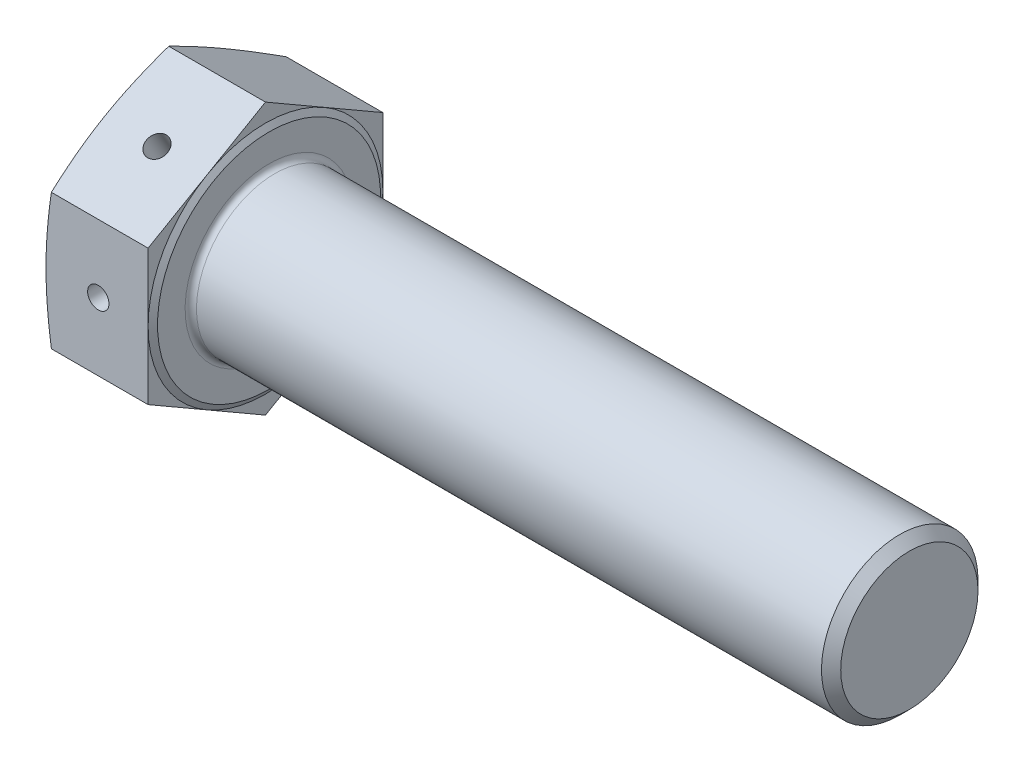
ISO-10303-21;
HEADER;
FILE_DESCRIPTION(('STEP AP214'),'2;1');
FILE_NAME('part.step','',(''),(''),'','','');
FILE_SCHEMA(('AUTOMOTIVE_DESIGN { 1 0 10303 214 1 1 1 1 }'));
ENDSEC;
DATA;
#1=APPLICATION_CONTEXT('core data for automotive mechanical design processes');
#2=APPLICATION_PROTOCOL_DEFINITION('international standard','automotive_design',2000,#1);
#3=PRODUCT_CONTEXT('',#1,'mechanical');
#4=PRODUCT('Part','Part','',(#3));
#5=PRODUCT_RELATED_PRODUCT_CATEGORY('part','',(#4));
#6=PRODUCT_DEFINITION_FORMATION('','',#4);
#7=PRODUCT_DEFINITION_CONTEXT('part definition',#1,'design');
#8=PRODUCT_DEFINITION('design','',#6,#7);
#9=PRODUCT_DEFINITION_SHAPE('','',#8);
#10=(LENGTH_UNIT() NAMED_UNIT(*) SI_UNIT(.MILLI.,.METRE.));
#11=(NAMED_UNIT(*) PLANE_ANGLE_UNIT() SI_UNIT($,.RADIAN.));
#12=(NAMED_UNIT(*) SI_UNIT($,.STERADIAN.) SOLID_ANGLE_UNIT());
#13=UNCERTAINTY_MEASURE_WITH_UNIT(LENGTH_MEASURE(1.E-05),#10,'distance_accuracy_value','');
#14=(GEOMETRIC_REPRESENTATION_CONTEXT(3) GLOBAL_UNCERTAINTY_ASSIGNED_CONTEXT((#13)) GLOBAL_UNIT_ASSIGNED_CONTEXT((#10,
#11,#12)) REPRESENTATION_CONTEXT('',''));
#15=CARTESIAN_POINT('',(0.,0.,0.));
#16=DIRECTION('',(0.,0.,1.));
#17=DIRECTION('',(1.,0.,0.));
#18=AXIS2_PLACEMENT_3D('',#15,#16,#17);
#19=CARTESIAN_POINT('',(7.35,0.,-16.5));
#20=DIRECTION('',(0.,0.,1.));
#21=DIRECTION('',(1.,0.,0.));
#22=AXIS2_PLACEMENT_3D('',#19,#20,#21);
#23=CYLINDRICAL_SURFACE('',#22,1.5);
#24=CARTESIAN_POINT('',(7.35,0.,16.5));
#25=DIRECTION('',(0.,0.,1.));
#26=DIRECTION('',(1.,0.,0.));
#27=AXIS2_PLACEMENT_3D('',#24,#25,#26);
#28=CIRCLE('',#27,1.5);
#29=CARTESIAN_POINT('',(8.85,0.,16.5));
#30=VERTEX_POINT('',#29);
#31=EDGE_CURVE('E584',#30,#30,#28,.T.);
#32=ORIENTED_EDGE('',*,*,#31,.T.);
#33=EDGE_LOOP('',(#32));
#34=FACE_BOUND('',#33,.T.);
#35=CARTESIAN_POINT('',(7.35,0.,0.));
#36=DIRECTION('',(0.,-0.866025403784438,0.500000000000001));
#37=DIRECTION('',(0.,0.500000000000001,0.866025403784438));
#38=AXIS2_PLACEMENT_3D('',#35,#36,#37);
#39=ELLIPSE('',#38,2.99999999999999,1.5);
#40=CARTESIAN_POINT('',(5.85,0.,0.));
#41=VERTEX_POINT('',#40);
#42=CARTESIAN_POINT('',(8.85,0.,0.));
#43=VERTEX_POINT('',#42);
#44=EDGE_CURVE('E46',#41,#43,#39,.F.);
#45=ORIENTED_EDGE('',*,*,#44,.T.);
#46=CARTESIAN_POINT('',(7.35,0.,0.));
#47=DIRECTION('',(0.,0.500000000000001,0.866025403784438));
#48=DIRECTION('',(0.,-0.866025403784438,0.500000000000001));
#49=AXIS2_PLACEMENT_3D('',#46,#47,#48);
#50=ELLIPSE('',#49,1.73205080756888,1.5);
#51=EDGE_CURVE('E11',#43,#41,#50,.F.);
#52=ORIENTED_EDGE('',*,*,#51,.T.);
#53=EDGE_LOOP('',(#45,#52));
#54=FACE_BOUND('',#53,.T.);
#55=ADVANCED_FACE('F32',(#34,#54),#23,.F.);
#56=CARTESIAN_POINT('',(14.85,0.,0.));
#57=DIRECTION('',(-1.,0.,0.));
#58=DIRECTION('',(0.,-1.,0.));
#59=AXIS2_PLACEMENT_3D('',#56,#57,#58);
#60=PLANE('',#59);
#61=CARTESIAN_POINT('',(14.85,0.,0.));
#62=DIRECTION('',(-1.,0.,0.));
#63=DIRECTION('',(0.,-1.,0.));
#64=AXIS2_PLACEMENT_3D('',#61,#62,#63);
#65=CIRCLE('',#64,11.8);
#66=CARTESIAN_POINT('',(14.85,-11.8,0.));
#67=VERTEX_POINT('',#66);
#68=EDGE_CURVE('E137',#67,#67,#65,.T.);
#69=ORIENTED_EDGE('',*,*,#68,.T.);
#70=EDGE_LOOP('',(#69));
#71=FACE_BOUND('',#70,.T.);
#72=CARTESIAN_POINT('',(14.85,0.,0.));
#73=DIRECTION('',(-1.,0.,0.));
#74=DIRECTION('',(0.,-1.,0.));
#75=AXIS2_PLACEMENT_3D('',#72,#73,#74);
#76=CIRCLE('',#75,15.675);
#77=CARTESIAN_POINT('',(14.85,-15.675,0.));
#78=VERTEX_POINT('',#77);
#79=EDGE_CURVE('E284',#78,#78,#76,.T.);
#80=ORIENTED_EDGE('',*,*,#79,.F.);
#81=EDGE_LOOP('',(#80));
#82=FACE_BOUND('',#81,.T.);
#83=ADVANCED_FACE('F239',(#71,#82),#60,.F.);
#84=CARTESIAN_POINT('',(14.35,-19.0525588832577,0.));
#85=DIRECTION('',(1.,0.,0.));
#86=DIRECTION('',(0.,0.,-1.));
#87=AXIS2_PLACEMENT_3D('',#84,#85,#86);
#88=PLANE('',#87);
#89=DIRECTION('',(0.,-0.5,-0.866025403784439));
#90=VECTOR('',#89,1.);
#91=CARTESIAN_POINT('',(14.35,-9.52627944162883,16.5));
#92=LINE('',#91,#90);
#93=CARTESIAN_POINT('',(14.35,-9.52627944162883,16.5));
#94=VERTEX_POINT('',#93);
#95=CARTESIAN_POINT('',(14.35,-14.2894191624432,8.25000000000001));
#96=VERTEX_POINT('',#95);
#97=EDGE_CURVE('E197',#94,#96,#92,.T.);
#98=ORIENTED_EDGE('',*,*,#97,.T.);
#99=CARTESIAN_POINT('',(14.35,0.,0.));
#100=DIRECTION('',(-1.,0.,0.));
#101=DIRECTION('',(0.,-1.,0.));
#102=AXIS2_PLACEMENT_3D('',#99,#100,#101);
#103=CIRCLE('',#102,16.5);
#104=CARTESIAN_POINT('',(14.35,0.,16.5));
#105=VERTEX_POINT('',#104);
#106=EDGE_CURVE('E54',#96,#105,#103,.T.);
#107=ORIENTED_EDGE('',*,*,#106,.T.);
#108=DIRECTION('',(0.,-1.,0.));
#109=VECTOR('',#108,1.);
#110=CARTESIAN_POINT('',(14.35,9.52627944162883,16.5));
#111=LINE('',#110,#109);
#112=EDGE_CURVE('E180',#105,#94,#111,.T.);
#113=ORIENTED_EDGE('',*,*,#112,.T.);
#114=EDGE_LOOP('',(#98,#107,#113));
#115=FACE_BOUND('',#114,.T.);
#116=ADVANCED_FACE('F245',(#115),#88,.T.);
#117=CARTESIAN_POINT('',(14.35,9.52627944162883,16.5));
#118=VERTEX_POINT('',#117);
#119=EDGE_CURVE('E177',#118,#105,#111,.T.);
#120=ORIENTED_EDGE('',*,*,#119,.T.);
#121=CARTESIAN_POINT('',(14.35,14.2894191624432,8.25));
#122=VERTEX_POINT('',#121);
#123=EDGE_CURVE('E153',#105,#122,#103,.T.);
#124=ORIENTED_EDGE('',*,*,#123,.T.);
#125=DIRECTION('',(0.,-0.5,0.866025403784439));
#126=VECTOR('',#125,1.);
#127=CARTESIAN_POINT('',(14.35,19.0525588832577,0.));
#128=LINE('',#127,#126);
#129=EDGE_CURVE('E184',#122,#118,#128,.T.);
#130=ORIENTED_EDGE('',*,*,#129,.T.);
#131=EDGE_LOOP('',(#120,#124,#130));
#132=FACE_BOUND('',#131,.T.);
#133=ADVANCED_FACE('F341',(#132),#88,.T.);
#134=CARTESIAN_POINT('',(14.35,19.0525588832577,0.));
#135=VERTEX_POINT('',#134);
#136=EDGE_CURVE('E181',#135,#122,#128,.T.);
#137=ORIENTED_EDGE('',*,*,#136,.T.);
#138=CARTESIAN_POINT('',(14.35,14.2894191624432,-8.25));
#139=VERTEX_POINT('',#138);
#140=EDGE_CURVE('E346',#122,#139,#103,.T.);
#141=ORIENTED_EDGE('',*,*,#140,.T.);
#142=DIRECTION('',(0.,0.5,0.866025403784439));
#143=VECTOR('',#142,1.);
#144=CARTESIAN_POINT('',(14.35,9.52627944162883,-16.5));
#145=LINE('',#144,#143);
#146=EDGE_CURVE('E188',#139,#135,#145,.T.);
#147=ORIENTED_EDGE('',*,*,#146,.T.);
#148=EDGE_LOOP('',(#137,#141,#147));
#149=FACE_BOUND('',#148,.T.);
#150=ADVANCED_FACE('F345',(#149),#88,.T.);
#151=CARTESIAN_POINT('',(14.35,9.52627944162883,-16.5));
#152=VERTEX_POINT('',#151);
#153=EDGE_CURVE('E185',#152,#139,#145,.T.);
#154=ORIENTED_EDGE('',*,*,#153,.T.);
#155=CARTESIAN_POINT('',(14.35,0.,-16.5));
#156=VERTEX_POINT('',#155);
#157=EDGE_CURVE('E405',#139,#156,#103,.T.);
#158=ORIENTED_EDGE('',*,*,#157,.T.);
#159=DIRECTION('',(0.,1.,0.));
#160=VECTOR('',#159,1.);
#161=CARTESIAN_POINT('',(14.35,-9.52627944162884,-16.5));
#162=LINE('',#161,#160);
#163=EDGE_CURVE('E192',#156,#152,#162,.T.);
#164=ORIENTED_EDGE('',*,*,#163,.T.);
#165=EDGE_LOOP('',(#154,#158,#164));
#166=FACE_BOUND('',#165,.T.);
#167=ADVANCED_FACE('F398',(#166),#88,.T.);
#168=CARTESIAN_POINT('',(14.35,-9.52627944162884,-16.5));
#169=VERTEX_POINT('',#168);
#170=EDGE_CURVE('E189',#169,#156,#162,.T.);
#171=ORIENTED_EDGE('',*,*,#170,.T.);
#172=CARTESIAN_POINT('',(14.35,-14.2894191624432,-8.25));
#173=VERTEX_POINT('',#172);
#174=EDGE_CURVE('E403',#156,#173,#103,.T.);
#175=ORIENTED_EDGE('',*,*,#174,.T.);
#176=DIRECTION('',(0.,0.5,-0.866025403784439));
#177=VECTOR('',#176,1.);
#178=CARTESIAN_POINT('',(14.35,-19.0525588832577,0.));
#179=LINE('',#178,#177);
#180=EDGE_CURVE('E196',#173,#169,#179,.T.);
#181=ORIENTED_EDGE('',*,*,#180,.T.);
#182=EDGE_LOOP('',(#171,#175,#181));
#183=FACE_BOUND('',#182,.T.);
#184=ADVANCED_FACE('F393',(#183),#88,.T.);
#185=CARTESIAN_POINT('',(14.35,-19.0525588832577,0.));
#186=VERTEX_POINT('',#185);
#187=EDGE_CURVE('E193',#186,#173,#179,.T.);
#188=ORIENTED_EDGE('',*,*,#187,.T.);
#189=EDGE_CURVE('E292',#173,#96,#103,.T.);
#190=ORIENTED_EDGE('',*,*,#189,.T.);
#191=EDGE_CURVE('E200',#96,#186,#92,.T.);
#192=ORIENTED_EDGE('',*,*,#191,.T.);
#193=EDGE_LOOP('',(#188,#190,#192));
#194=FACE_BOUND('',#193,.T.);
#195=ADVANCED_FACE('F234',(#194),#88,.T.);
#196=CARTESIAN_POINT('',(14.35,-9.52627944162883,16.5));
#197=DIRECTION('',(0.,0.866025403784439,-0.5));
#198=DIRECTION('',(0.,0.5,0.866025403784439));
#199=AXIS2_PLACEMENT_3D('',#196,#197,#198);
#200=PLANE('',#199);
#201=CARTESIAN_POINT('',(0.756136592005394,-19.0526743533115,-0.000200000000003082));
#202=CARTESIAN_POINT('',(0.697583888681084,-18.8549969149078,0.342187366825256));
#203=CARTESIAN_POINT('',(0.641700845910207,-18.6571223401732,0.684916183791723));
#204=CARTESIAN_POINT('',(0.535835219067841,-18.2609673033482,1.37107683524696));
#205=CARTESIAN_POINT('',(0.485852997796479,-18.0626868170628,1.71450871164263));
#206=CARTESIAN_POINT('',(0.345568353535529,-17.4670798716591,2.74613020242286));
#207=CARTESIAN_POINT('',(0.264980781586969,-17.0691629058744,3.43534260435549));
#208=CARTESIAN_POINT('',(0.134453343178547,-16.2745788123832,4.81160262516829));
#209=CARTESIAN_POINT('',(0.0843237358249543,-15.877919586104,5.49863655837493));
#210=CARTESIAN_POINT('',(0.0171010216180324,-15.0839798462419,6.87378052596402));
#211=CARTESIAN_POINT('',(0.,-14.6866995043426,7.56189026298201));
#212=CARTESIAN_POINT('',(0.,-13.8921388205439,8.93810973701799));
#213=CARTESIAN_POINT('',(0.0171010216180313,-13.4948584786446,9.62621947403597));
#214=CARTESIAN_POINT('',(0.0843237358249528,-12.7009187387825,11.0013634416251));
#215=CARTESIAN_POINT('',(0.134453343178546,-12.3042595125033,11.6883973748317));
#216=CARTESIAN_POINT('',(0.264980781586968,-11.5096754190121,13.0646573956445));
#217=CARTESIAN_POINT('',(0.345568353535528,-11.1117584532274,13.7538697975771));
#218=CARTESIAN_POINT('',(0.485852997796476,-10.5161515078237,14.7854912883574));
#219=CARTESIAN_POINT('',(0.535835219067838,-10.3178710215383,15.128923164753));
#220=CARTESIAN_POINT('',(0.641700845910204,-9.92171598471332,15.8150838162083));
#221=CARTESIAN_POINT('',(0.697583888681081,-9.72384140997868,16.1578126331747));
#222=CARTESIAN_POINT('',(0.756136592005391,-9.52616397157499,16.5002));
#223=B_SPLINE_CURVE_WITH_KNOTS('',3,(#201,#202,#203,#204,#205,#206,#207,#208,#209,#210,#211,
#212,#213,#214,#215,#216,#217,#218,#219,#220,#221,#222),.UNSPECIFIED.,.F.,.F.,(4,2,2,2,2,2,2,2,
2,2,4),(0.,1.19898576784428,2.39804521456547,4.79722541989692,7.18130221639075,9.5648076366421,
11.9483130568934,14.3323898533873,16.7315700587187,17.9306295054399,19.1296152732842),.UNSPECIFIED.);
#224=CARTESIAN_POINT('',(0.75610238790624,-19.0525588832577,0.));
#225=VERTEX_POINT('',#224);
#226=CARTESIAN_POINT('',(0.,-14.2894191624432,8.24999999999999));
#227=VERTEX_POINT('',#226);
#228=EDGE_CURVE('E356',#225,#227,#223,.T.);
#229=ORIENTED_EDGE('',*,*,#228,.F.);
#230=DIRECTION('',(-1.,0.,0.));
#231=VECTOR('',#230,1.);
#232=CARTESIAN_POINT('',(14.35,-19.0525588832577,0.));
#233=LINE('',#232,#231);
#234=EDGE_CURVE('E158',#186,#225,#233,.T.);
#235=ORIENTED_EDGE('',*,*,#234,.F.);
#236=ORIENTED_EDGE('',*,*,#191,.F.);
#237=ORIENTED_EDGE('',*,*,#97,.F.);
#238=DIRECTION('',(-1.,0.,0.));
#239=VECTOR('',#238,1.);
#240=CARTESIAN_POINT('',(14.35,-9.52627944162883,16.5));
#241=LINE('',#240,#239);
#242=CARTESIAN_POINT('',(0.756102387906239,-9.52627944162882,16.5));
#243=VERTEX_POINT('',#242);
#244=EDGE_CURVE('E174',#94,#243,#241,.T.);
#245=ORIENTED_EDGE('',*,*,#244,.T.);
#246=EDGE_CURVE('E333',#227,#243,#223,.T.);
#247=ORIENTED_EDGE('',*,*,#246,.F.);
#248=EDGE_LOOP('',(#229,#235,#236,#237,#245,#247));
#249=FACE_BOUND('',#248,.T.);
#250=ADVANCED_FACE('F34',(#249),#200,.F.);
#251=CARTESIAN_POINT('',(14.35,-19.0525588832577,0.));
#252=DIRECTION('',(0.,0.866025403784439,0.5));
#253=DIRECTION('',(0.,-0.5,0.866025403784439));
#254=AXIS2_PLACEMENT_3D('',#251,#252,#253);
#255=PLANE('',#254);
#256=CARTESIAN_POINT('',(7.35,-14.2894191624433,-8.24999999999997));
#257=DIRECTION('',(0.,0.866025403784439,0.5));
#258=DIRECTION('',(0.,-0.5,0.866025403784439));
#259=AXIS2_PLACEMENT_3D('',#256,#257,#258);
#260=CIRCLE('',#259,1.5);
#261=CARTESIAN_POINT('',(7.35,-15.0394191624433,-6.95096189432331));
#262=VERTEX_POINT('',#261);
#263=EDGE_CURVE('E582',#262,#262,#260,.T.);
#264=ORIENTED_EDGE('',*,*,#263,.T.);
#265=EDGE_LOOP('',(#264));
#266=FACE_BOUND('',#265,.T.);
#267=CARTESIAN_POINT('',(0.756136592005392,-9.52616397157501,-16.5002));
#268=CARTESIAN_POINT('',(0.697583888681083,-9.72384140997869,-16.1578126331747));
#269=CARTESIAN_POINT('',(0.641700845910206,-9.92171598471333,-15.8150838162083));
#270=CARTESIAN_POINT('',(0.53583521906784,-10.3178710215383,-15.128923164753));
#271=CARTESIAN_POINT('',(0.485852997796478,-10.5161515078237,-14.7854912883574));
#272=CARTESIAN_POINT('',(0.34556835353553,-11.1117584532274,-13.7538697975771));
#273=CARTESIAN_POINT('',(0.264980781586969,-11.5096754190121,-13.0646573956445));
#274=CARTESIAN_POINT('',(0.134453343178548,-12.3042595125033,-11.6883973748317));
#275=CARTESIAN_POINT('',(0.084323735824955,-12.7009187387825,-11.0013634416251));
#276=CARTESIAN_POINT('',(0.0171010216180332,-13.4948584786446,-9.62621947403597));
#277=CARTESIAN_POINT('',(0.,-13.8921388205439,-8.93810973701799));
#278=CARTESIAN_POINT('',(0.,-14.6866995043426,-7.56189026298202));
#279=CARTESIAN_POINT('',(0.0171010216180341,-15.0839798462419,-6.87378052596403));
#280=CARTESIAN_POINT('',(0.084323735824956,-15.877919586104,-5.49863655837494));
#281=CARTESIAN_POINT('',(0.134453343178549,-16.2745788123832,-4.8116026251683));
#282=CARTESIAN_POINT('',(0.26498078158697,-17.0691629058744,-3.4353426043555));
#283=CARTESIAN_POINT('',(0.34556835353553,-17.4670798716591,-2.74613020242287));
#284=CARTESIAN_POINT('',(0.485852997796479,-18.0626868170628,-1.71450871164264));
#285=CARTESIAN_POINT('',(0.535835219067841,-18.2609673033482,-1.37107683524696));
#286=CARTESIAN_POINT('',(0.641700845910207,-18.6571223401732,-0.684916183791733));
#287=CARTESIAN_POINT('',(0.697583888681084,-18.8549969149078,-0.342187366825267));
#288=CARTESIAN_POINT('',(0.756136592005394,-19.0526743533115,0.000199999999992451));
#289=B_SPLINE_CURVE_WITH_KNOTS('',3,(#267,#268,#269,#270,#271,#272,#273,#274,#275,#276,#277,
#278,#279,#280,#281,#282,#283,#284,#285,#286,#287,#288),.UNSPECIFIED.,.F.,.F.,(4,2,2,2,2,2,2,2,
2,2,4),(0.,1.19898576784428,2.39804521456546,4.79722541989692,7.18130221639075,9.56480763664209,
11.9483130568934,14.3323898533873,16.7315700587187,17.9306295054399,19.1296152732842),.UNSPECIFIED.);
#290=CARTESIAN_POINT('',(0.756102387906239,-9.52627944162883,-16.5));
#291=VERTEX_POINT('',#290);
#292=CARTESIAN_POINT('',(0.,-14.2894191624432,-8.25));
#293=VERTEX_POINT('',#292);
#294=EDGE_CURVE('E355',#291,#293,#289,.T.);
#295=ORIENTED_EDGE('',*,*,#294,.F.);
#296=DIRECTION('',(-1.,0.,0.));
#297=VECTOR('',#296,1.);
#298=CARTESIAN_POINT('',(14.35,-9.52627944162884,-16.5));
#299=LINE('',#298,#297);
#300=EDGE_CURVE('E162',#169,#291,#299,.T.);
#301=ORIENTED_EDGE('',*,*,#300,.F.);
#302=ORIENTED_EDGE('',*,*,#180,.F.);
#303=ORIENTED_EDGE('',*,*,#187,.F.);
#304=ORIENTED_EDGE('',*,*,#234,.T.);
#305=EDGE_CURVE('E210',#293,#225,#289,.T.);
#306=ORIENTED_EDGE('',*,*,#305,.F.);
#307=EDGE_LOOP('',(#295,#301,#302,#303,#304,#306));
#308=FACE_BOUND('',#307,.T.);
#309=ADVANCED_FACE('F224',(#266,#308),#255,.F.);
#310=CARTESIAN_POINT('',(14.35,-9.52627944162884,-16.5));
#311=DIRECTION('',(0.,0.,1.));
#312=DIRECTION('',(1.,0.,0.));
#313=AXIS2_PLACEMENT_3D('',#310,#311,#312);
#314=PLANE('',#313);
#315=CARTESIAN_POINT('',(7.35,0.,-16.5));
#316=DIRECTION('',(0.,0.,1.));
#317=DIRECTION('',(1.,0.,0.));
#318=AXIS2_PLACEMENT_3D('',#315,#316,#317);
#319=CIRCLE('',#318,1.5);
#320=CARTESIAN_POINT('',(8.85,0.,-16.5));
#321=VERTEX_POINT('',#320);
#322=EDGE_CURVE('E290',#321,#321,#319,.T.);
#323=ORIENTED_EDGE('',*,*,#322,.T.);
#324=EDGE_LOOP('',(#323));
#325=FACE_BOUND('',#324,.T.);
#326=CARTESIAN_POINT('',(4.0340208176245,-25.1968576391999,-16.5));
#327=CARTESIAN_POINT('',(3.94131801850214,-24.8227594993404,-16.5));
#328=CARTESIAN_POINT('',(3.84919520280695,-24.4485177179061,-16.5));
#329=CARTESIAN_POINT('',(3.66623770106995,-23.6997178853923,-16.5));
#330=CARTESIAN_POINT('',(3.57540302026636,-23.3251598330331,-16.5));
#331=CARTESIAN_POINT('',(3.30501577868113,-22.2009358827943,-16.5));
#332=CARTESIAN_POINT('',(3.12758906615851,-21.4507565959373,-16.5));
#333=CARTESIAN_POINT('',(2.77947761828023,-19.9478810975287,-16.5));
#334=CARTESIAN_POINT('',(2.60880124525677,-19.1951829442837,-16.5));
#335=CARTESIAN_POINT('',(2.27606057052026,-17.687886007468,-16.5));
#336=CARTESIAN_POINT('',(2.11399618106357,-16.9332872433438,-16.5));
#337=CARTESIAN_POINT('',(1.80210388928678,-15.4293089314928,-16.5));
#338=CARTESIAN_POINT('',(1.65217113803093,-14.6799512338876,-16.5));
#339=CARTESIAN_POINT('',(1.36531841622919,-13.1787294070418,-16.5));
#340=CARTESIAN_POINT('',(1.22839850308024,-12.4268652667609,-16.5));
#341=CARTESIAN_POINT('',(0.970686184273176,-10.9204815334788,-16.5));
#342=CARTESIAN_POINT('',(0.849891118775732,-10.1659623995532,-16.5));
#343=CARTESIAN_POINT('',(0.628022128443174,-8.65399583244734,-16.5));
#344=CARTESIAN_POINT('',(0.526948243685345,-7.8965483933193,-16.5));
#345=CARTESIAN_POINT('',(0.347200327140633,-6.36809174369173,-16.5));
#346=CARTESIAN_POINT('',(0.268863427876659,-5.59704227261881,-16.5));
#347=CARTESIAN_POINT('',(0.140474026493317,-4.05257189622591,-16.5));
#348=CARTESIAN_POINT('',(0.090420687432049,-3.2791510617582,-16.5));
#349=CARTESIAN_POINT('',(0.0216102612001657,-1.73132931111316,-16.5));
#350=CARTESIAN_POINT('',(0.00283541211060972,-0.956929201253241,-16.5));
#351=CARTESIAN_POINT('',(-0.00223766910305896,0.591979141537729,-16.5));
#352=CARTESIAN_POINT('',(0.0114640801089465,1.36648737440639,-16.5));
#353=CARTESIAN_POINT('',(0.070567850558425,2.91771949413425,-16.5));
#354=CARTESIAN_POINT('',(0.116110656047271,3.69443790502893,-16.5));
#355=CARTESIAN_POINT('',(0.236245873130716,5.24560414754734,-16.5));
#356=CARTESIAN_POINT('',(0.310839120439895,6.020051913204,-16.5));
#357=CARTESIAN_POINT('',(0.485244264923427,7.56670543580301,-16.5));
#358=CARTESIAN_POINT('',(0.585076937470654,8.33890881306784,-16.5));
#359=CARTESIAN_POINT('',(0.805746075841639,9.88027456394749,-16.5));
#360=CARTESIAN_POINT('',(0.926582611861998,10.6494369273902,-16.5));
#361=CARTESIAN_POINT('',(1.1760926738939,12.129781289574,-16.5));
#362=CARTESIAN_POINT('',(1.30358239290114,12.8411648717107,-16.5));
#363=CARTESIAN_POINT('',(1.57063816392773,14.2616726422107,-16.5));
#364=CARTESIAN_POINT('',(1.71020460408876,14.9707967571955,-16.5));
#365=CARTESIAN_POINT('',(1.99919508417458,16.3871105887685,-16.5));
#366=CARTESIAN_POINT('',(2.14862028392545,17.0943000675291,-16.5));
#367=CARTESIAN_POINT('',(2.455499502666,18.5069206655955,-16.5));
#368=CARTESIAN_POINT('',(2.61295343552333,19.2123518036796,-16.5));
#369=CARTESIAN_POINT('',(2.93447541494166,20.6218785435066,-16.5));
#370=CARTESIAN_POINT('',(3.09854503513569,21.3259737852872,-16.5));
#371=CARTESIAN_POINT('',(3.43210149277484,22.732878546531,-16.5));
#372=CARTESIAN_POINT('',(3.60158834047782,23.4356880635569,-16.5));
#373=CARTESIAN_POINT('',(3.94503654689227,24.8401550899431,-16.5));
#374=CARTESIAN_POINT('',(4.11899756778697,25.5418126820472,-16.5));
#375=CARTESIAN_POINT('',(4.47066899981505,26.9441884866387,-16.5));
#376=CARTESIAN_POINT('',(4.64837942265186,27.6449066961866,-16.5));
#377=CARTESIAN_POINT('',(5.18189527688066,29.7290121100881,-16.5));
#378=CARTESIAN_POINT('',(5.54224816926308,31.1112351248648,-16.5));
#379=CARTESIAN_POINT('',(6.27177233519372,33.873374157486,-16.5));
#380=CARTESIAN_POINT('',(6.64094379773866,35.2532901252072,-16.5));
#381=CARTESIAN_POINT('',(7.3853198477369,38.009411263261,-16.5));
#382=CARTESIAN_POINT('',(7.76051522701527,39.3856189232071,-16.5));
#383=CARTESIAN_POINT('',(8.32703030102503,41.4488782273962,-16.5));
#384=CARTESIAN_POINT('',(8.51648538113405,42.1364429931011,-16.5));
#385=CARTESIAN_POINT('',(8.8964960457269,43.5112674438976,-16.5));
#386=CARTESIAN_POINT('',(9.08705162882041,44.1985271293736,-16.5));
#387=CARTESIAN_POINT('',(9.27808647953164,44.8856536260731,-16.5));
#388=B_SPLINE_CURVE_WITH_KNOTS('',3,(#326,#327,#328,#329,#330,#331,#332,#333,#334,#335,#336,
#337,#338,#339,#340,#341,#342,#343,#344,#345,#346,#347,#348,#349,#350,#351,#352,#353,#354,#355,
#356,#357,#358,#359,#360,#361,#362,#363,#364,#365,#366,#367,#368,#369,#370,#371,#372,#373,#374,
#375,#376,#377,#378,#379,#380,#381,#382,#383,#384,#385,#386,#387),.UNSPECIFIED.,.F.,.F.,(4,2,2,
2,2,2,2,2,2,2,2,2,2,2,2,2,2,2,2,2,2,2,2,2,2,2,2,2,2,2,4),(0.,1.15623831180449,2.3124813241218,
4.62507988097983,6.94045886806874,9.25581426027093,11.5483522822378,13.8409004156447,
16.1330699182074,18.425244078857,20.7498468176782,23.0743807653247,25.3975942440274,
27.7208063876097,30.0543560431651,32.3879728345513,34.7235167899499,37.0590685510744,
39.2270974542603,41.3951960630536,43.5635501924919,45.7318810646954,47.9007307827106,
50.0695846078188,52.2382751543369,54.4069724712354,58.692197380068,62.9775142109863,
67.2568084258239,69.3963747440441,71.5359383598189),.UNSPECIFIED.);
#389=CARTESIAN_POINT('',(0.756102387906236,9.52627944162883,-16.5));
#390=VERTEX_POINT('',#389);
#391=CARTESIAN_POINT('',(0.,0.,-16.5));
#392=VERTEX_POINT('',#391);
#393=EDGE_CURVE('E208',#390,#392,#388,.F.);
#394=ORIENTED_EDGE('',*,*,#393,.F.);
#395=DIRECTION('',(-1.,0.,0.));
#396=VECTOR('',#395,1.);
#397=CARTESIAN_POINT('',(14.35,9.52627944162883,-16.5));
#398=LINE('',#397,#396);
#399=EDGE_CURVE('E165',#152,#390,#398,.T.);
#400=ORIENTED_EDGE('',*,*,#399,.F.);
#401=ORIENTED_EDGE('',*,*,#163,.F.);
#402=ORIENTED_EDGE('',*,*,#170,.F.);
#403=ORIENTED_EDGE('',*,*,#300,.T.);
#404=EDGE_CURVE('E201',#392,#291,#388,.F.);
#405=ORIENTED_EDGE('',*,*,#404,.F.);
#406=EDGE_LOOP('',(#394,#400,#401,#402,#403,#405));
#407=FACE_BOUND('',#406,.T.);
#408=ADVANCED_FACE('F219',(#325,#407),#314,.F.);
#409=CARTESIAN_POINT('',(14.35,9.52627944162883,-16.5));
#410=DIRECTION('',(0.,-0.866025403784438,0.5));
#411=DIRECTION('',(0.,-0.5,-0.866025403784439));
#412=AXIS2_PLACEMENT_3D('',#409,#410,#411);
#413=PLANE('',#412);
#414=CARTESIAN_POINT('',(0.756136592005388,19.0526743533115,0.000199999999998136));
#415=CARTESIAN_POINT('',(0.697583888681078,18.8549969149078,-0.342187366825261));
#416=CARTESIAN_POINT('',(0.641700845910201,18.6571223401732,-0.684916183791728));
#417=CARTESIAN_POINT('',(0.535835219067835,18.2609673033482,-1.37107683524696));
#418=CARTESIAN_POINT('',(0.485852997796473,18.0626868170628,-1.71450871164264));
#419=CARTESIAN_POINT('',(0.345568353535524,17.467079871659,-2.74613020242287));
#420=CARTESIAN_POINT('',(0.264980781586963,17.0691629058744,-3.4353426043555));
#421=CARTESIAN_POINT('',(0.134453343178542,16.2745788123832,-4.81160262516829));
#422=CARTESIAN_POINT('',(0.0843237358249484,15.877919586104,-5.49863655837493));
#423=CARTESIAN_POINT('',(0.0171010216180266,15.0839798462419,-6.87378052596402));
#424=CARTESIAN_POINT('',(0.,14.6866995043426,-7.56189026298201));
#425=CARTESIAN_POINT('',(0.,13.8921388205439,-8.93810973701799));
#426=CARTESIAN_POINT('',(0.017101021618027,13.4948584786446,-9.62621947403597));
#427=CARTESIAN_POINT('',(0.0843237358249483,12.7009187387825,-11.0013634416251));
#428=CARTESIAN_POINT('',(0.134453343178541,12.3042595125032,-11.6883973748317));
#429=CARTESIAN_POINT('',(0.264980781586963,11.5096754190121,-13.0646573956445));
#430=CARTESIAN_POINT('',(0.345568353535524,11.1117584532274,-13.7538697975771));
#431=CARTESIAN_POINT('',(0.485852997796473,10.5161515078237,-14.7854912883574));
#432=CARTESIAN_POINT('',(0.535835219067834,10.3178710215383,-15.128923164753));
#433=CARTESIAN_POINT('',(0.6417008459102,9.92171598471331,-15.8150838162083));
#434=CARTESIAN_POINT('',(0.697583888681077,9.72384140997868,-16.1578126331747));
#435=CARTESIAN_POINT('',(0.756136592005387,9.52616397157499,-16.5002));
#436=B_SPLINE_CURVE_WITH_KNOTS('',3,(#414,#415,#416,#417,#418,#419,#420,#421,#422,#423,#424,
#425,#426,#427,#428,#429,#430,#431,#432,#433,#434,#435),.UNSPECIFIED.,.F.,.F.,(4,2,2,2,2,2,2,2,
2,2,4),(0.,1.19898576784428,2.39804521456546,4.79722541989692,7.18130221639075,9.5648076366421,
11.9483130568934,14.3323898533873,16.7315700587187,17.9306295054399,19.1296152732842),.UNSPECIFIED.);
#437=CARTESIAN_POINT('',(0.756102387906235,19.0525588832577,0.));
#438=VERTEX_POINT('',#437);
#439=CARTESIAN_POINT('',(0.,14.2894191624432,-8.25000000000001));
#440=VERTEX_POINT('',#439);
#441=EDGE_CURVE('E352',#438,#440,#436,.T.);
#442=ORIENTED_EDGE('',*,*,#441,.F.);
#443=DIRECTION('',(-1.,0.,0.));
#444=VECTOR('',#443,1.);
#445=CARTESIAN_POINT('',(14.35,19.0525588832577,0.));
#446=LINE('',#445,#444);
#447=EDGE_CURVE('E168',#135,#438,#446,.T.);
#448=ORIENTED_EDGE('',*,*,#447,.F.);
#449=ORIENTED_EDGE('',*,*,#146,.F.);
#450=ORIENTED_EDGE('',*,*,#153,.F.);
#451=ORIENTED_EDGE('',*,*,#399,.T.);
#452=EDGE_CURVE('E209',#440,#390,#436,.T.);
#453=ORIENTED_EDGE('',*,*,#452,.F.);
#454=EDGE_LOOP('',(#442,#448,#449,#450,#451,#453));
#455=FACE_BOUND('',#454,.T.);
#456=ADVANCED_FACE('F223',(#455),#413,.F.);
#457=CARTESIAN_POINT('',(14.35,19.0525588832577,0.));
#458=DIRECTION('',(0.,-0.866025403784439,-0.5));
#459=DIRECTION('',(0.,0.5,-0.866025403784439));
#460=AXIS2_PLACEMENT_3D('',#457,#458,#459);
#461=PLANE('',#460);
#462=CARTESIAN_POINT('',(7.35,14.2894191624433,8.24999999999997));
#463=DIRECTION('',(0.,-0.866025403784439,-0.5));
#464=DIRECTION('',(0.,0.5,-0.866025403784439));
#465=AXIS2_PLACEMENT_3D('',#462,#463,#464);
#466=CIRCLE('',#465,1.5);
#467=CARTESIAN_POINT('',(7.35,15.0394191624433,6.95096189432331));
#468=VERTEX_POINT('',#467);
#469=EDGE_CURVE('E323',#468,#468,#466,.T.);
#470=ORIENTED_EDGE('',*,*,#469,.T.);
#471=EDGE_LOOP('',(#470));
#472=FACE_BOUND('',#471,.T.);
#473=CARTESIAN_POINT('',(0.756136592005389,9.52616397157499,16.5002));
#474=CARTESIAN_POINT('',(0.697583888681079,9.72384140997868,16.1578126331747));
#475=CARTESIAN_POINT('',(0.641700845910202,9.92171598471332,15.8150838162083));
#476=CARTESIAN_POINT('',(0.535835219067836,10.3178710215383,15.128923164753));
#477=CARTESIAN_POINT('',(0.485852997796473,10.5161515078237,14.7854912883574));
#478=CARTESIAN_POINT('',(0.345568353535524,11.1117584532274,13.7538697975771));
#479=CARTESIAN_POINT('',(0.264980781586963,11.5096754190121,13.0646573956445));
#480=CARTESIAN_POINT('',(0.134453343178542,12.3042595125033,11.6883973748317));
#481=CARTESIAN_POINT('',(0.0843237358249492,12.7009187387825,11.0013634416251));
#482=CARTESIAN_POINT('',(0.0171010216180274,13.4948584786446,9.62621947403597));
#483=CARTESIAN_POINT('',(0.,13.8921388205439,8.93810973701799));
#484=CARTESIAN_POINT('',(0.,14.6866995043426,7.56189026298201));
#485=CARTESIAN_POINT('',(0.0171010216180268,15.0839798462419,6.87378052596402));
#486=CARTESIAN_POINT('',(0.0843237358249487,15.877919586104,5.49863655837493));
#487=CARTESIAN_POINT('',(0.134453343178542,16.2745788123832,4.81160262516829));
#488=CARTESIAN_POINT('',(0.264980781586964,17.0691629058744,3.43534260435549));
#489=CARTESIAN_POINT('',(0.345568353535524,17.467079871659,2.74613020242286));
#490=CARTESIAN_POINT('',(0.485852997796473,18.0626868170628,1.71450871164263));
#491=CARTESIAN_POINT('',(0.535835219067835,18.2609673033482,1.37107683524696));
#492=CARTESIAN_POINT('',(0.641700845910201,18.6571223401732,0.684916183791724));
#493=CARTESIAN_POINT('',(0.697583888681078,18.8549969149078,0.342187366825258));
#494=CARTESIAN_POINT('',(0.756136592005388,19.0526743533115,-0.00020000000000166));
#495=B_SPLINE_CURVE_WITH_KNOTS('',3,(#473,#474,#475,#476,#477,#478,#479,#480,#481,#482,#483,
#484,#485,#486,#487,#488,#489,#490,#491,#492,#493,#494),.UNSPECIFIED.,.F.,.F.,(4,2,2,2,2,2,2,2,
2,2,4),(0.,1.19898576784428,2.39804521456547,4.79722541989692,7.18130221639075,9.5648076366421,
11.9483130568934,14.3323898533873,16.7315700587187,17.9306295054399,19.1296152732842),.UNSPECIFIED.);
#496=CARTESIAN_POINT('',(0.756102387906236,9.52627944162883,16.5));
#497=VERTEX_POINT('',#496);
#498=CARTESIAN_POINT('',(0.,14.2894191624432,8.24999999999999));
#499=VERTEX_POINT('',#498);
#500=EDGE_CURVE('E301',#497,#499,#495,.T.);
#501=ORIENTED_EDGE('',*,*,#500,.F.);
#502=DIRECTION('',(-1.,0.,0.));
#503=VECTOR('',#502,1.);
#504=CARTESIAN_POINT('',(14.35,9.52627944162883,16.5));
#505=LINE('',#504,#503);
#506=EDGE_CURVE('E171',#118,#497,#505,.T.);
#507=ORIENTED_EDGE('',*,*,#506,.F.);
#508=ORIENTED_EDGE('',*,*,#129,.F.);
#509=ORIENTED_EDGE('',*,*,#136,.F.);
#510=ORIENTED_EDGE('',*,*,#447,.T.);
#511=EDGE_CURVE('E329',#499,#438,#495,.T.);
#512=ORIENTED_EDGE('',*,*,#511,.F.);
#513=EDGE_LOOP('',(#501,#507,#508,#509,#510,#512));
#514=FACE_BOUND('',#513,.T.);
#515=ADVANCED_FACE('F311',(#472,#514),#461,.F.);
#516=CARTESIAN_POINT('',(14.35,9.52627944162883,16.5));
#517=DIRECTION('',(0.,0.,-1.));
#518=DIRECTION('',(-1.,0.,0.));
#519=AXIS2_PLACEMENT_3D('',#516,#517,#518);
#520=PLANE('',#519);
#521=ORIENTED_EDGE('',*,*,#31,.F.);
#522=EDGE_LOOP('',(#521));
#523=FACE_BOUND('',#522,.T.);
#524=CARTESIAN_POINT('',(4.0340208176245,-25.1968576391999,16.5));
#525=CARTESIAN_POINT('',(3.94131801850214,-24.8227594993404,16.5));
#526=CARTESIAN_POINT('',(3.84919520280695,-24.4485177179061,16.5));
#527=CARTESIAN_POINT('',(3.66623770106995,-23.6997178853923,16.5));
#528=CARTESIAN_POINT('',(3.57540302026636,-23.3251598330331,16.5));
#529=CARTESIAN_POINT('',(3.30501577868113,-22.2009358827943,16.5));
#530=CARTESIAN_POINT('',(3.12758906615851,-21.4507565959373,16.5));
#531=CARTESIAN_POINT('',(2.77947761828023,-19.9478810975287,16.5));
#532=CARTESIAN_POINT('',(2.60880124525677,-19.1951829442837,16.5));
#533=CARTESIAN_POINT('',(2.27606057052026,-17.687886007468,16.5));
#534=CARTESIAN_POINT('',(2.11399618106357,-16.9332872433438,16.5));
#535=CARTESIAN_POINT('',(1.80210388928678,-15.4293089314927,16.5));
#536=CARTESIAN_POINT('',(1.65217113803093,-14.6799512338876,16.5));
#537=CARTESIAN_POINT('',(1.36531841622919,-13.1787294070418,16.5));
#538=CARTESIAN_POINT('',(1.22839850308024,-12.4268652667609,16.5));
#539=CARTESIAN_POINT('',(0.970686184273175,-10.9204815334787,16.5));
#540=CARTESIAN_POINT('',(0.849891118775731,-10.1659623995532,16.5));
#541=CARTESIAN_POINT('',(0.628022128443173,-8.65399583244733,16.5));
#542=CARTESIAN_POINT('',(0.526948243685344,-7.89654839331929,16.5));
#543=CARTESIAN_POINT('',(0.347200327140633,-6.36809174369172,16.5));
#544=CARTESIAN_POINT('',(0.268863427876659,-5.5970422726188,16.5));
#545=CARTESIAN_POINT('',(0.140474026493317,-4.0525718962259,16.5));
#546=CARTESIAN_POINT('',(0.0904206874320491,-3.27915106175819,16.5));
#547=CARTESIAN_POINT('',(0.0216102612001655,-1.73132931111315,16.5));
#548=CARTESIAN_POINT('',(0.00283541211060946,-0.956929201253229,16.5));
#549=CARTESIAN_POINT('',(-0.0022376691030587,0.59197914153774,16.5));
#550=CARTESIAN_POINT('',(0.0114640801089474,1.3664873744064,16.5));
#551=CARTESIAN_POINT('',(0.0705678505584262,2.91771949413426,16.5));
#552=CARTESIAN_POINT('',(0.116110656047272,3.69443790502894,16.5));
#553=CARTESIAN_POINT('',(0.236245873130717,5.24560414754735,16.5));
#554=CARTESIAN_POINT('',(0.310839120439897,6.02005191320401,16.5));
#555=CARTESIAN_POINT('',(0.485244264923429,7.56670543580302,16.5));
#556=CARTESIAN_POINT('',(0.585076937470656,8.33890881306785,16.5));
#557=CARTESIAN_POINT('',(0.805746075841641,9.8802745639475,16.5));
#558=CARTESIAN_POINT('',(0.926582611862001,10.6494369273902,16.5));
#559=CARTESIAN_POINT('',(1.17609267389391,12.129781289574,16.5));
#560=CARTESIAN_POINT('',(1.30358239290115,12.8411648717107,16.5));
#561=CARTESIAN_POINT('',(1.57063816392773,14.2616726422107,16.5));
#562=CARTESIAN_POINT('',(1.71020460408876,14.9707967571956,16.5));
#563=CARTESIAN_POINT('',(1.99919508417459,16.3871105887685,16.5));
#564=CARTESIAN_POINT('',(2.14862028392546,17.0943000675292,16.5));
#565=CARTESIAN_POINT('',(2.455499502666,18.5069206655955,16.5));
#566=CARTESIAN_POINT('',(2.61295343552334,19.2123518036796,16.5));
#567=CARTESIAN_POINT('',(2.93447541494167,20.6218785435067,16.5));
#568=CARTESIAN_POINT('',(3.09854503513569,21.3259737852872,16.5));
#569=CARTESIAN_POINT('',(3.43210149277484,22.732878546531,16.5));
#570=CARTESIAN_POINT('',(3.60158834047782,23.4356880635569,16.5));
#571=CARTESIAN_POINT('',(3.94503654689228,24.8401550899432,16.5));
#572=CARTESIAN_POINT('',(4.11899756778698,25.5418126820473,16.5));
#573=CARTESIAN_POINT('',(4.47066899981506,26.9441884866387,16.5));
#574=CARTESIAN_POINT('',(4.64837942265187,27.6449066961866,16.5));
#575=CARTESIAN_POINT('',(5.18189527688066,29.7290121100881,16.5));
#576=CARTESIAN_POINT('',(5.54224816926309,31.1112351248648,16.5));
#577=CARTESIAN_POINT('',(6.27177233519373,33.873374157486,16.5));
#578=CARTESIAN_POINT('',(6.64094379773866,35.2532901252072,16.5));
#579=CARTESIAN_POINT('',(7.3853198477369,38.009411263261,16.5));
#580=CARTESIAN_POINT('',(7.76051522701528,39.3856189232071,16.5));
#581=CARTESIAN_POINT('',(8.32703030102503,41.4488782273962,16.5));
#582=CARTESIAN_POINT('',(8.51648538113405,42.1364429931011,16.5));
#583=CARTESIAN_POINT('',(8.8964960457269,43.5112674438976,16.5));
#584=CARTESIAN_POINT('',(9.08705162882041,44.1985271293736,16.5));
#585=CARTESIAN_POINT('',(9.27808647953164,44.885653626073,16.5));
#586=B_SPLINE_CURVE_WITH_KNOTS('',3,(#524,#525,#526,#527,#528,#529,#530,#531,#532,#533,#534,
#535,#536,#537,#538,#539,#540,#541,#542,#543,#544,#545,#546,#547,#548,#549,#550,#551,#552,#553,
#554,#555,#556,#557,#558,#559,#560,#561,#562,#563,#564,#565,#566,#567,#568,#569,#570,#571,#572,
#573,#574,#575,#576,#577,#578,#579,#580,#581,#582,#583,#584,#585),.UNSPECIFIED.,.F.,.F.,(4,2,2,
2,2,2,2,2,2,2,2,2,2,2,2,2,2,2,2,2,2,2,2,2,2,2,2,2,2,2,4),(0.,1.15623831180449,2.31248132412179,
4.62507988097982,6.94045886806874,9.25581426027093,11.5483522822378,13.8409004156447,
16.1330699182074,18.425244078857,20.7498468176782,23.0743807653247,25.3975942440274,
27.7208063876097,30.0543560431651,32.3879728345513,34.7235167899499,37.0590685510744,
39.2270974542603,41.3951960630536,43.5635501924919,45.7318810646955,47.9007307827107,
50.0695846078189,52.2382751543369,54.4069724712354,58.692197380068,62.9775142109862,
67.2568084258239,69.3963747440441,71.5359383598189),.UNSPECIFIED.);
#587=CARTESIAN_POINT('',(0.,0.,16.5));
#588=VERTEX_POINT('',#587);
#589=EDGE_CURVE('E300',#243,#588,#586,.T.);
#590=ORIENTED_EDGE('',*,*,#589,.F.);
#591=ORIENTED_EDGE('',*,*,#244,.F.);
#592=ORIENTED_EDGE('',*,*,#112,.F.);
#593=ORIENTED_EDGE('',*,*,#119,.F.);
#594=ORIENTED_EDGE('',*,*,#506,.T.);
#595=EDGE_CURVE('E288',#588,#497,#586,.T.);
#596=ORIENTED_EDGE('',*,*,#595,.F.);
#597=EDGE_LOOP('',(#590,#591,#592,#593,#594,#596));
#598=FACE_BOUND('',#597,.T.);
#599=ADVANCED_FACE('F306',(#523,#598),#520,.F.);
#600=CARTESIAN_POINT('',(0.,0.,0.));
#601=DIRECTION('',(1.,0.,0.));
#602=DIRECTION('',(0.,1.,0.));
#603=AXIS2_PLACEMENT_3D('',#600,#601,#602);
#604=CONICAL_SURFACE('',#603,16.5,1.28281700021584);
#605=ORIENTED_EDGE('',*,*,#404,.T.);
#606=ORIENTED_EDGE('',*,*,#294,.T.);
#607=CARTESIAN_POINT('',(0.,0.,0.));
#608=DIRECTION('',(1.,0.,0.));
#609=DIRECTION('',(0.,0.,-1.));
#610=AXIS2_PLACEMENT_3D('',#607,#608,#609);
#611=CIRCLE('',#610,16.5);
#612=EDGE_CURVE('E154',#293,#392,#611,.T.);
#613=ORIENTED_EDGE('',*,*,#612,.T.);
#614=EDGE_LOOP('',(#605,#606,#613));
#615=FACE_BOUND('',#614,.T.);
#616=ADVANCED_FACE('F310',(#615),#604,.T.);
#617=ORIENTED_EDGE('',*,*,#305,.T.);
#618=ORIENTED_EDGE('',*,*,#228,.T.);
#619=EDGE_CURVE('E157',#227,#293,#611,.T.);
#620=ORIENTED_EDGE('',*,*,#619,.T.);
#621=EDGE_LOOP('',(#617,#618,#620));
#622=FACE_BOUND('',#621,.T.);
#623=ADVANCED_FACE('F377',(#622),#604,.T.);
#624=ORIENTED_EDGE('',*,*,#246,.T.);
#625=ORIENTED_EDGE('',*,*,#589,.T.);
#626=CARTESIAN_POINT('',(0.,0.,0.));
#627=DIRECTION('',(-1.,0.,0.));
#628=DIRECTION('',(0.,-1.,0.));
#629=AXIS2_PLACEMENT_3D('',#626,#627,#628);
#630=CIRCLE('',#629,16.5);
#631=EDGE_CURVE('E286',#227,#588,#630,.T.);
#632=ORIENTED_EDGE('',*,*,#631,.F.);
#633=EDGE_LOOP('',(#624,#625,#632));
#634=FACE_BOUND('',#633,.T.);
#635=ADVANCED_FACE('F385',(#634),#604,.T.);
#636=ORIENTED_EDGE('',*,*,#500,.T.);
#637=EDGE_CURVE('E407',#499,#588,#611,.T.);
#638=ORIENTED_EDGE('',*,*,#637,.T.);
#639=ORIENTED_EDGE('',*,*,#595,.T.);
#640=EDGE_LOOP('',(#636,#638,#639));
#641=FACE_BOUND('',#640,.T.);
#642=ADVANCED_FACE('F409',(#641),#604,.T.);
#643=ORIENTED_EDGE('',*,*,#441,.T.);
#644=EDGE_CURVE('E406',#440,#499,#611,.T.);
#645=ORIENTED_EDGE('',*,*,#644,.T.);
#646=ORIENTED_EDGE('',*,*,#511,.T.);
#647=EDGE_LOOP('',(#643,#645,#646));
#648=FACE_BOUND('',#647,.T.);
#649=ADVANCED_FACE('F411',(#648),#604,.T.);
#650=ORIENTED_EDGE('',*,*,#393,.T.);
#651=EDGE_CURVE('E159',#392,#440,#611,.T.);
#652=ORIENTED_EDGE('',*,*,#651,.T.);
#653=ORIENTED_EDGE('',*,*,#452,.T.);
#654=EDGE_LOOP('',(#650,#652,#653));
#655=FACE_BOUND('',#654,.T.);
#656=ADVANCED_FACE('F215',(#655),#604,.T.);
#657=CARTESIAN_POINT('',(0.,-19.0525588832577,0.));
#658=DIRECTION('',(1.,0.,0.));
#659=DIRECTION('',(0.,0.,-1.));
#660=AXIS2_PLACEMENT_3D('',#657,#658,#659);
#661=PLANE('',#660);
#662=ORIENTED_EDGE('',*,*,#651,.F.);
#663=ORIENTED_EDGE('',*,*,#612,.F.);
#664=ORIENTED_EDGE('',*,*,#619,.F.);
#665=ORIENTED_EDGE('',*,*,#631,.T.);
#666=ORIENTED_EDGE('',*,*,#637,.F.);
#667=ORIENTED_EDGE('',*,*,#644,.F.);
#668=EDGE_LOOP('',(#662,#663,#664,#665,#666,#667));
#669=FACE_BOUND('',#668,.T.);
#670=ADVANCED_FACE('F276',(#669),#661,.F.);
#671=CARTESIAN_POINT('',(14.85,0.,0.));
#672=DIRECTION('',(-1.,0.,0.));
#673=DIRECTION('',(0.,-1.,0.));
#674=AXIS2_PLACEMENT_3D('',#671,#672,#673);
#675=CONICAL_SURFACE('',#674,15.675,1.02593241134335);
#676=ORIENTED_EDGE('',*,*,#106,.F.);
#677=ORIENTED_EDGE('',*,*,#189,.F.);
#678=ORIENTED_EDGE('',*,*,#174,.F.);
#679=ORIENTED_EDGE('',*,*,#157,.F.);
#680=ORIENTED_EDGE('',*,*,#140,.F.);
#681=ORIENTED_EDGE('',*,*,#123,.F.);
#682=EDGE_LOOP('',(#676,#677,#678,#679,#680,#681));
#683=FACE_BOUND('',#682,.T.);
#684=ORIENTED_EDGE('',*,*,#79,.T.);
#685=EDGE_LOOP('',(#684));
#686=FACE_BOUND('',#685,.T.);
#687=ADVANCED_FACE('F273',(#683,#686),#675,.T.);
#688=CARTESIAN_POINT('',(104.85,0.,0.));
#689=DIRECTION('',(-1.,0.,0.));
#690=DIRECTION('',(0.,-1.,0.));
#691=AXIS2_PLACEMENT_3D('',#688,#689,#690);
#692=CYLINDRICAL_SURFACE('',#691,11.);
#693=CARTESIAN_POINT('',(15.65,0.,0.));
#694=DIRECTION('',(-1.,0.,0.));
#695=DIRECTION('',(0.,-1.,0.));
#696=AXIS2_PLACEMENT_3D('',#693,#694,#695);
#697=CIRCLE('',#696,11.);
#698=CARTESIAN_POINT('',(15.65,-11.,0.));
#699=VERTEX_POINT('',#698);
#700=EDGE_CURVE('E144',#699,#699,#697,.F.);
#701=CARTESIAN_POINT('',(103.497,0.,0.));
#702=DIRECTION('',(1.,0.,0.));
#703=DIRECTION('',(0.,1.,0.));
#704=AXIS2_PLACEMENT_3D('',#701,#702,#703);
#705=CIRCLE('',#704,11.);
#706=CARTESIAN_POINT('',(103.497,-11.,0.));
#707=VERTEX_POINT('',#706);
#708=EDGE_CURVE('E147',#707,#707,#705,.F.);
#709=CARTESIAN_POINT('',(15.65,-11.,0.));
#710=CARTESIAN_POINT('',(16.5650729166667,-11.,0.));
#711=CARTESIAN_POINT('',(17.4801458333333,-11.,0.));
#712=CARTESIAN_POINT('',(19.3102916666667,-11.,0.));
#713=CARTESIAN_POINT('',(20.2253645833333,-11.,0.));
#714=CARTESIAN_POINT('',(22.0555104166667,-11.,0.));
#715=CARTESIAN_POINT('',(22.9705833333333,-11.,0.));
#716=CARTESIAN_POINT('',(24.8007291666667,-11.,0.));
#717=CARTESIAN_POINT('',(25.7158020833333,-11.,0.));
#718=CARTESIAN_POINT('',(27.5459479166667,-11.,0.));
#719=CARTESIAN_POINT('',(28.4610208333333,-11.,0.));
#720=CARTESIAN_POINT('',(30.2911666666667,-11.,0.));
#721=CARTESIAN_POINT('',(31.2062395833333,-11.,0.));
#722=CARTESIAN_POINT('',(33.0363854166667,-11.,0.));
#723=CARTESIAN_POINT('',(33.9514583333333,-11.,0.));
#724=CARTESIAN_POINT('',(35.7816041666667,-11.,0.));
#725=CARTESIAN_POINT('',(36.6966770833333,-11.,0.));
#726=CARTESIAN_POINT('',(38.5268229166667,-11.,0.));
#727=CARTESIAN_POINT('',(39.4418958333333,-11.,0.));
#728=CARTESIAN_POINT('',(41.2720416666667,-11.,0.));
#729=CARTESIAN_POINT('',(42.1871145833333,-11.,0.));
#730=CARTESIAN_POINT('',(44.0172604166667,-11.,0.));
#731=CARTESIAN_POINT('',(44.9323333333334,-11.,0.));
#732=CARTESIAN_POINT('',(46.7624791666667,-11.,0.));
#733=CARTESIAN_POINT('',(47.6775520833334,-11.,0.));
#734=CARTESIAN_POINT('',(49.5076979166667,-11.,0.));
#735=CARTESIAN_POINT('',(50.4227708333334,-11.,0.));
#736=CARTESIAN_POINT('',(52.2529166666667,-11.,0.));
#737=CARTESIAN_POINT('',(53.1679895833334,-11.,0.));
#738=CARTESIAN_POINT('',(54.9981354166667,-11.,0.));
#739=CARTESIAN_POINT('',(55.9132083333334,-11.,0.));
#740=CARTESIAN_POINT('',(57.7433541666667,-11.,0.));
#741=CARTESIAN_POINT('',(58.6584270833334,-11.,0.));
#742=CARTESIAN_POINT('',(60.4885729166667,-11.,0.));
#743=CARTESIAN_POINT('',(61.4036458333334,-11.,0.));
#744=CARTESIAN_POINT('',(63.2337916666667,-11.,0.));
#745=CARTESIAN_POINT('',(64.1488645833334,-11.,0.));
#746=CARTESIAN_POINT('',(65.9790104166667,-11.,0.));
#747=CARTESIAN_POINT('',(66.8940833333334,-11.,0.));
#748=CARTESIAN_POINT('',(68.7242291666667,-11.,0.));
#749=CARTESIAN_POINT('',(69.6393020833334,-11.,0.));
#750=CARTESIAN_POINT('',(71.4694479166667,-11.,0.));
#751=CARTESIAN_POINT('',(72.3845208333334,-11.,0.));
#752=CARTESIAN_POINT('',(74.2146666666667,-11.,0.));
#753=CARTESIAN_POINT('',(75.1297395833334,-11.,0.));
#754=CARTESIAN_POINT('',(76.9598854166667,-11.,0.));
#755=CARTESIAN_POINT('',(77.8749583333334,-11.,0.));
#756=CARTESIAN_POINT('',(79.7051041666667,-11.,0.));
#757=CARTESIAN_POINT('',(80.6201770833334,-11.,0.));
#758=CARTESIAN_POINT('',(82.4503229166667,-11.,0.));
#759=CARTESIAN_POINT('',(83.3653958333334,-11.,0.));
#760=CARTESIAN_POINT('',(85.1955416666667,-11.,0.));
#761=CARTESIAN_POINT('',(86.1106145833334,-11.,0.));
#762=CARTESIAN_POINT('',(87.9407604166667,-11.,0.));
#763=CARTESIAN_POINT('',(88.8558333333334,-11.,0.));
#764=CARTESIAN_POINT('',(90.6859791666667,-11.,0.));
#765=CARTESIAN_POINT('',(91.6010520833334,-11.,0.));
#766=CARTESIAN_POINT('',(93.4311979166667,-11.,0.));
#767=CARTESIAN_POINT('',(94.3462708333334,-11.,0.));
#768=CARTESIAN_POINT('',(96.1764166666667,-11.,0.));
#769=CARTESIAN_POINT('',(97.0914895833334,-11.,0.));
#770=CARTESIAN_POINT('',(98.9216354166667,-11.,0.));
#771=CARTESIAN_POINT('',(99.8367083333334,-11.,0.));
#772=CARTESIAN_POINT('',(101.666854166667,-11.,0.));
#773=CARTESIAN_POINT('',(102.581927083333,-11.,0.));
#774=CARTESIAN_POINT('',(103.497,-11.,0.));
#775=B_SPLINE_CURVE_WITH_KNOTS('',3,(#709,#710,#711,#712,#713,#714,#715,#716,#717,#718,#719,
#720,#721,#722,#723,#724,#725,#726,#727,#728,#729,#730,#731,#732,#733,#734,#735,#736,#737,#738,
#739,#740,#741,#742,#743,#744,#745,#746,#747,#748,#749,#750,#751,#752,#753,#754,#755,#756,#757,
#758,#759,#760,#761,#762,#763,#764,#765,#766,#767,#768,#769,#770,#771,#772,#773,#774),
.UNSPECIFIED.,.F.,.F.,(4,2,2,2,2,2,2,2,2,2,2,2,2,2,2,2,2,2,2,2,2,2,2,2,2,2,2,2,2,2,2,2,4),(0.,
2.74521875,5.4904375,8.23565625,10.980875,13.72609375,16.4713125,19.21653125,21.96175,
24.70696875,27.4521875,30.19740625,32.942625,35.68784375,38.4330625,41.17828125,43.9235,
46.66871875,49.4139375,52.15915625,54.904375,57.64959375,60.3948125,63.14003125,65.88525,
68.63046875,71.3756875,74.12090625,76.866125,79.61134375,82.3565625,85.10178125,87.847),.UNSPECIFIED.);
#776=EDGE_CURVE('BSEAM269',#699,#707,#775,.T.);
#777=ORIENTED_EDGE('',*,*,#700,.T.);
#778=ORIENTED_EDGE('',*,*,#708,.T.);
#779=ORIENTED_EDGE('',*,*,#776,.T.);
#780=ORIENTED_EDGE('',*,*,#776,.F.);
#781=EDGE_LOOP('',(#777,#779,#778,#780));
#782=FACE_BOUND('',#781,.T.);
#783=ADVANCED_FACE('F269',(#782),#692,.T.);
#784=CARTESIAN_POINT('',(104.85,0.,0.));
#785=DIRECTION('',(1.,0.,0.));
#786=DIRECTION('',(0.,1.,0.));
#787=AXIS2_PLACEMENT_3D('',#784,#785,#786);
#788=PLANE('',#787);
#789=CARTESIAN_POINT('',(104.85,0.,0.));
#790=DIRECTION('',(1.,0.,0.));
#791=DIRECTION('',(0.,1.,0.));
#792=AXIS2_PLACEMENT_3D('',#789,#790,#791);
#793=CIRCLE('',#792,9.64700000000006);
#794=CARTESIAN_POINT('',(104.85,9.64700000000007,0.));
#795=VERTEX_POINT('',#794);
#796=EDGE_CURVE('E150',#795,#795,#793,.T.);
#797=ORIENTED_EDGE('',*,*,#796,.T.);
#798=EDGE_LOOP('',(#797));
#799=FACE_BOUND('',#798,.T.);
#800=ADVANCED_FACE('F261',(#799),#788,.T.);
#801=CARTESIAN_POINT('',(104.85,0.,0.));
#802=DIRECTION('',(-1.,0.,0.));
#803=DIRECTION('',(0.,-1.,0.));
#804=AXIS2_PLACEMENT_3D('',#801,#802,#803);
#805=CONICAL_SURFACE('',#804,9.64700000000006,0.785398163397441);
#806=ORIENTED_EDGE('',*,*,#708,.F.);
#807=EDGE_LOOP('',(#806));
#808=FACE_BOUND('',#807,.T.);
#809=ORIENTED_EDGE('',*,*,#796,.F.);
#810=EDGE_LOOP('',(#809));
#811=FACE_BOUND('',#810,.T.);
#812=ADVANCED_FACE('F256',(#808,#811),#805,.T.);
#813=CARTESIAN_POINT('',(15.65,0.,0.));
#814=DIRECTION('',(-1.,0.,0.));
#815=DIRECTION('',(0.,-1.,0.));
#816=AXIS2_PLACEMENT_3D('',#813,#814,#815);
#817=TOROIDAL_SURFACE('',#816,11.8,0.8);
#818=ORIENTED_EDGE('',*,*,#68,.F.);
#819=EDGE_LOOP('',(#818));
#820=FACE_BOUND('',#819,.T.);
#821=ORIENTED_EDGE('',*,*,#700,.F.);
#822=EDGE_LOOP('',(#821));
#823=FACE_BOUND('',#822,.T.);
#824=ADVANCED_FACE('F251',(#820,#823),#817,.F.);
#825=CARTESIAN_POINT('',(7.35,0.,0.));
#826=DIRECTION('',(0.,-0.866025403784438,0.500000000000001));
#827=DIRECTION('',(0.,0.500000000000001,0.866025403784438));
#828=AXIS2_PLACEMENT_3D('',#825,#826,#827);
#829=ELLIPSE('',#828,2.99999999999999,1.5);
#830=EDGE_CURVE('E128',#41,#43,#829,.T.);
#831=ORIENTED_EDGE('',*,*,#830,.T.);
#832=CARTESIAN_POINT('',(7.35,0.,0.));
#833=DIRECTION('',(0.,0.500000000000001,0.866025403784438));
#834=DIRECTION('',(0.,-0.866025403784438,0.500000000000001));
#835=AXIS2_PLACEMENT_3D('',#832,#833,#834);
#836=ELLIPSE('',#835,1.73205080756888,1.5);
#837=EDGE_CURVE('E41',#43,#41,#836,.T.);
#838=ORIENTED_EDGE('',*,*,#837,.T.);
#839=EDGE_LOOP('',(#831,#838));
#840=FACE_BOUND('',#839,.T.);
#841=ORIENTED_EDGE('',*,*,#322,.F.);
#842=EDGE_LOOP('',(#841));
#843=FACE_BOUND('',#842,.T.);
#844=ADVANCED_FACE('F139',(#840,#843),#23,.F.);
#845=CARTESIAN_POINT('',(7.35,-21.4341287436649,-12.375));
#846=DIRECTION('',(0.,0.86602540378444,0.499999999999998));
#847=DIRECTION('',(0.,-0.499999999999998,0.86602540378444));
#848=AXIS2_PLACEMENT_3D('',#845,#846,#847);
#849=CYLINDRICAL_SURFACE('',#848,1.5);
#850=ORIENTED_EDGE('',*,*,#44,.F.);
#851=ORIENTED_EDGE('',*,*,#837,.F.);
#852=EDGE_LOOP('',(#850,#851));
#853=FACE_BOUND('',#852,.T.);
#854=ORIENTED_EDGE('',*,*,#469,.F.);
#855=EDGE_LOOP('',(#854));
#856=FACE_BOUND('',#855,.T.);
#857=ADVANCED_FACE('F135',(#853,#856),#849,.F.);
#858=ORIENTED_EDGE('',*,*,#830,.F.);
#859=ORIENTED_EDGE('',*,*,#51,.F.);
#860=EDGE_LOOP('',(#858,#859));
#861=FACE_BOUND('',#860,.T.);
#862=ORIENTED_EDGE('',*,*,#263,.F.);
#863=EDGE_LOOP('',(#862));
#864=FACE_BOUND('',#863,.T.);
#865=ADVANCED_FACE('F129',(#861,#864),#849,.F.);
#866=CLOSED_SHELL('',(#55,#83,#116,#133,#150,#167,#184,#195,#250,#309,#408,#456,#515,#599,#616,
#623,#635,#642,#649,#656,#670,#687,#783,#800,#812,#824,#844,#857,#865));
#867=MANIFOLD_SOLID_BREP('B2',#866);
#868=ADVANCED_BREP_SHAPE_REPRESENTATION('',(#18,#867),#14);
#869=SHAPE_DEFINITION_REPRESENTATION(#9,#868);
ENDSEC;
END-ISO-10303-21;
